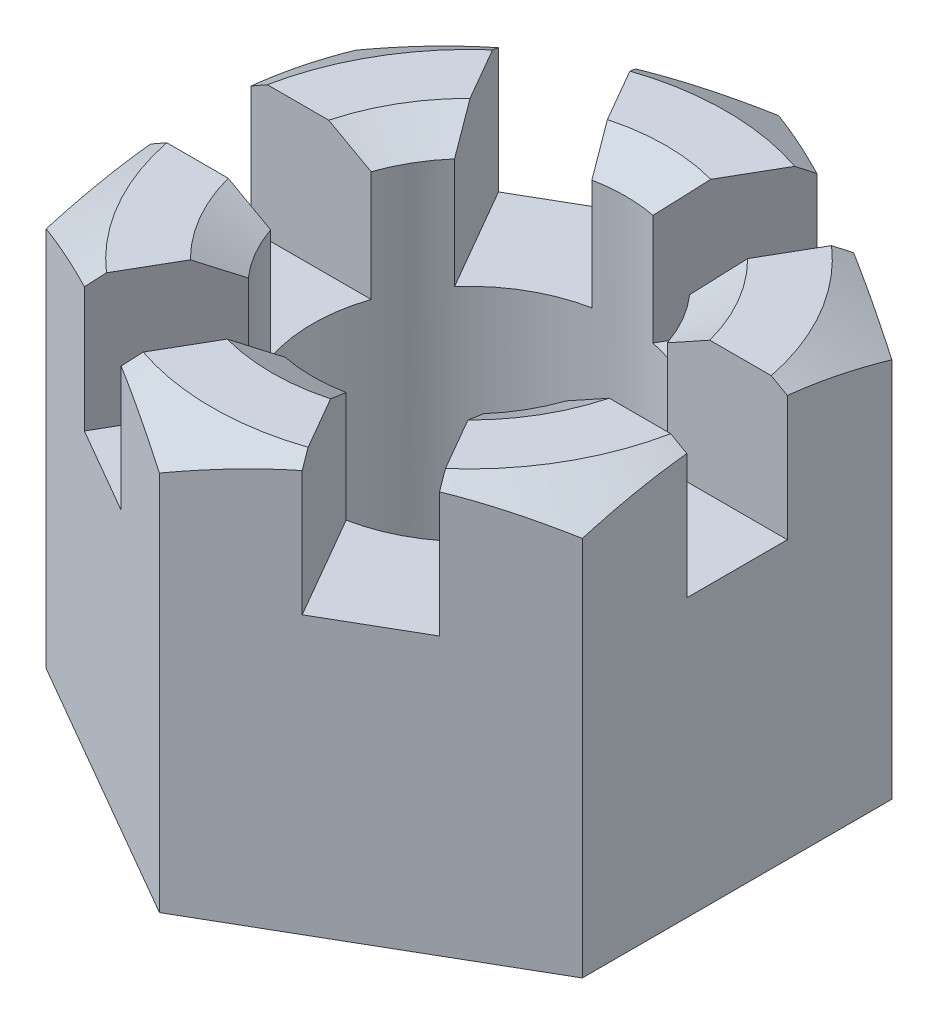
from build123d import *

# Parameters (mm, degrees)
BASENUT_DEPTH    = 19
HOLESKE_R        = 7
TAPPEDHOLE_DEPTH = 27.400757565
CHAMFER1_SIZE    = 1.05
CHAMFER1_SIZE2   = 1.818653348
SLOTSKE_W        = 4.5
SLOTSKE_H        = 19
SLOT_DEPTH       = 28.8
SLOTPAT_COUNT    = 6
CUTBOTTOMSKE_R   = 22.3
CUTBOTTOMSKE_R_2 = 11.15
CUTBOTTOM_DEPTH  = 0.6


with BuildPart() as part:
    # BaseNutSke → BaseNut (new body)
    with BuildSketch(Plane(origin=(0, 0, 0), x_dir=(1, 0, 0), z_dir=(0, 1, 0))):
        Polygon((0, 13.856406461), (-12, 6.92820323), (-12, -6.92820323), (0, -13.856406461), (12, -6.92820323), (12, 6.92820323), align=None)
    extrude(amount=BASENUT_DEPTH)

    # CutNutSke → CutNut (revolve, cut)
    with BuildSketch(Plane(origin=(0, 0, 0), x_dir=(0, 0, -1), z_dir=(1, 0, 0)), mode=Mode.PRIVATE) as cutnut_sk:
        Polygon((-13.856406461, 19), (-11.5, 19), (-13.856406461, 17.639528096), align=None)
    revolve(cutnut_sk.sketch.rotate(Axis((0, 0, 0), (0, 1, 0)), 180), axis=Axis((0, 0, 0), (0, 1, 0)), mode=Mode.SUBTRACT)

    # HoleSke → TappedHole (cut, through all)
    with BuildSketch(Plane(origin=(0, 0, 0), x_dir=(1, 0, 0), z_dir=(0, 1, 0))):
        with Locations(Location((0, 0, 0), (0, 0, 270))):
            Circle(HOLESKE_R)
    extrude(amount=TAPPEDHOLE_DEPTH, mode=Mode.SUBTRACT)

    # Chamfer1
    chamfer1_edges = [part.edges().sort_by_distance(p)[0] for p in [
        (0, 0, -7),
        (0, 19, -7),
    ]]
    chamfer1_side = [part.faces().sort_by_distance(p)[0] for p in [
        (0, 9.5, -7),
    ]]
    chamfer(chamfer1_edges, length=CHAMFER1_SIZE, length2=CHAMFER1_SIZE2, reference=chamfer1_side[0])

    # SlotSke → Slot (cut)
    with BuildSketch(Plane(origin=(0, 0, 0), x_dir=(0, 0, -1), z_dir=(1, 0, 0))):
        with Locations((0, 22.5)):
            Rectangle(SLOTSKE_W, SLOTSKE_H)
    slot = extrude(amount=-SLOT_DEPTH, mode=Mode.SUBTRACT)

    # SlotPat: Slot ×6 about axis
    slotpat_axis = Axis((0, 0, 0), (0, 1, 0))
    for i in range(1, SLOTPAT_COUNT):
        add(slot.rotate(slotpat_axis, i * 360 / SLOTPAT_COUNT), mode=Mode.SUBTRACT)

    # CutBottomSke → CutBottom (cut)
    with BuildSketch(Plane(origin=(0, 0, 0), x_dir=(1, 0, 0), z_dir=(0, 1, 0))):
        Circle(CUTBOTTOMSKE_R)
        with Locations(Location((0, 0, 0), (0, 0, 270))):
            Circle(CUTBOTTOMSKE_R_2, mode=Mode.SUBTRACT)
    extrude(amount=CUTBOTTOM_DEPTH, mode=Mode.SUBTRACT)


solid = part.part
